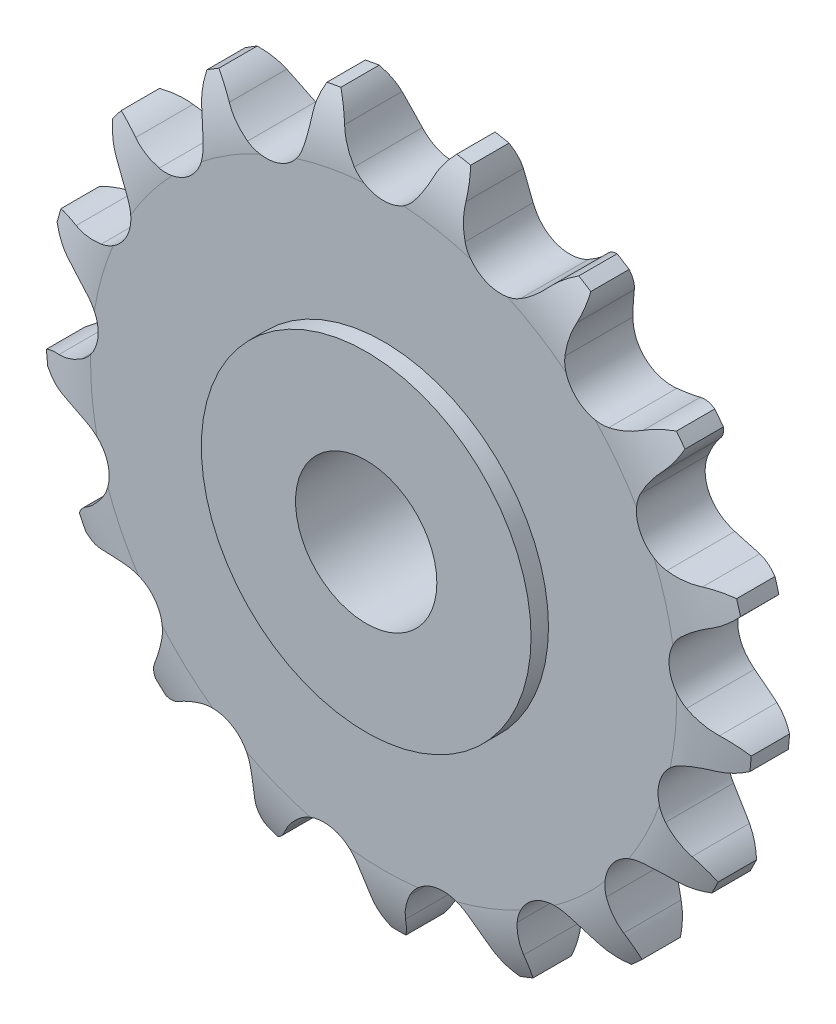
from build123d import *

# Parameters (mm, degrees)
CUT_EXTRUDE_1_DEPTH      = 54.31744555
CUT_EXTRUDE_1_DEPTH_BACK = 54.31744555


with BuildPart() as part:
    # Sketch 1 → Revolve 1 (revolve)
    with BuildSketch(Plane(origin=(0, 0, 0), x_dir=(0, 0, -1), z_dir=(1, 0, 0)), mode=Mode.PRIVATE) as revolve_1_sk:
        with BuildLine():
            Line((-5.5, 7.5), (-5.5, 17.5))
            Line((-5.5, 17.5), (-3.65, 17.5))
            Line((-3.65, 17.5), (-3.65, 31.1))
            ThreePointArc((-3.65, 31.1), (-3.240423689, 34.400122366), (-2.036547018, 37.5))
            Line((-2.036547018, 37.5), (2.036547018, 37.5))
            ThreePointArc((2.036547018, 37.5), (3.240424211, 34.400120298), (3.65, 31.099995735))
            Line((3.65, 31.099995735), (3.65, 17.5))
            Line((3.65, 17.5), (5.5, 17.5))
            Line((5.5, 17.5), (5.5, 7.5))
            Line((5.5, 7.5), (-5.5, 7.5))
        make_face()
    revolve(revolve_1_sk.sketch.rotate(Axis((0, 0, 10.5), (0, 0, -1)), 90), axis=Axis((0, 0, 10.5), (0, 0, -1)))

    # Sketch 2 → Cut-Extrude 1 (cut, two sides: drawn at the far end of the back side and taken through both)
    with BuildSketch(Plane.XY.offset(-CUT_EXTRUDE_1_DEPTH_BACK)):
        with BuildLine():
            ThreePointArc((6.147542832, 36.992671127), (-2e-09, 37.5), (-6.147542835, 36.992671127))
            ThreePointArc((-6.147542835, 36.992671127), (-5.332344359, 35.947140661), (-4.742176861, 34.759965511))
            ThreePointArc((-4.742176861, 34.759965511), (-4.055871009, 33.297555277), (-3.150969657, 31.959342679))
            ThreePointArc((-3.150969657, 31.959342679), (-1e-09, 30.4405), (3.150969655, 31.959342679))
            ThreePointArc((3.150969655, 31.959342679), (4.055871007, 33.297555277), (4.742176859, 34.759965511))
            ThreePointArc((4.742176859, 34.759965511), (5.332344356, 35.947140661), (6.147542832, 36.992671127))
        make_face()
        with BuildLine():
            ThreePointArc((19.095707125, 32.273889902), (13.54656248, 34.967708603), (7.630881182, 36.715387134))
            ThreePointArc((7.630881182, 36.715387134), (8.013341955, 35.445975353), (8.134799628, 34.125774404))
            ThreePointArc((8.134799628, 34.125774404), (8.246477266, 32.514195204), (8.606854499, 30.939461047))
            ThreePointArc((8.606854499, 30.939461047), (10.996376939, 28.3849209), (14.483237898, 28.66293799))
            ThreePointArc((14.483237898, 28.66293799), (15.810451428, 29.583896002), (16.978696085, 30.699630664))
            ThreePointArc((16.978696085, 30.699630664), (17.957868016, 31.593445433), (19.095707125, 32.273889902))
        make_face()
        with BuildLine():
            ThreePointArc((29.464890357, 23.19634101), (25.263586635, 27.712834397), (20.378712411, 31.479486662))
            ThreePointArc((20.378712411, 31.479486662), (20.276782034, 30.157634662), (19.913126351, 28.882708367))
            ThreePointArc((19.913126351, 28.882708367), (19.435093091, 27.339612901), (19.202275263, 25.741033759))
            ThreePointArc((19.202275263, 25.741033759), (20.50763224, 22.495800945), (23.859464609, 21.495444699))
            ThreePointArc((23.859464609, 21.495444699), (25.429742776, 21.874767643), (26.922148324, 22.493140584))
            ThreePointArc((26.922148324, 22.493140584), (28.158082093, 22.972880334), (29.464890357, 23.19634101))
        make_face()
        with BuildLine():
            ThreePointArc((35.854676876, 10.985997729), (33.568623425, 16.715188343), (30.374285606, 21.992107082))
            ThreePointArc((30.374285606, 21.992107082), (29.801730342, 20.7963383), (29.002075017, 19.73887252))
            ThreePointArc((29.002075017, 19.73887252), (27.998891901, 18.472664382), (27.204322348, 17.066137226))
            ThreePointArc((27.204322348, 17.066137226), (27.24921817, 13.56849842), (30.013338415, 11.424872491))
            ThreePointArc((30.013338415, 11.424872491), (31.61460645, 11.2113307), (33.22961525, 11.248827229))
            ThreePointArc((33.22961525, 11.248827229), (34.555391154, 11.249700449), (35.854676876, 10.985997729))
        make_face()
        with BuildLine():
            ThreePointArc((37.402090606, -2.708065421), (37.340031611, 3.460063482), (36.267643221, 9.534571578))
            ThreePointArc((36.267643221, 9.534571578), (35.30178983, 8.626381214), (34.174132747, 7.929192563))
            ThreePointArc((34.174132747, 7.929192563), (32.781285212, 7.110880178), (31.532274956, 6.086364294))
            ThreePointArc((31.532274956, 6.086364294), (30.310646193, 2.808694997), (32.113744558, -0.188692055))
            ThreePointArc((32.113744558, -0.188692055), (33.52974234, -0.966258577), (35.049238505, -1.514702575))
            ThreePointArc((35.049238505, -1.514702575), (36.285803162, -1.992813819), (37.402090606, -2.708065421))
        make_face()
        with BuildLine():
            ThreePointArc((33.898144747, -16.03638933), (36.068461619, -10.262362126), (37.262854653, -4.21066065))
            ThreePointArc((37.262854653, -4.21066065), (36.034146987, -4.708616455), (34.730784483, -4.951368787))
            ThreePointArc((34.730784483, -4.951368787), (33.136384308, -5.211267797), (31.601619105, -5.715405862))
            ThreePointArc((31.601619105, -5.715405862), (29.278453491, -8.330438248), (29.87701155, -11.776772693))
            ThreePointArc((29.87701155, -11.776772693), (30.916500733, -13.013349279), (32.135267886, -14.073663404))
            ThreePointArc((32.135267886, -14.073663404), (33.115616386, -14.966187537), (33.898144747, -16.03638933))
        make_face()
        with BuildLine():
            ThreePointArc((25.816066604, -27.198909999), (29.925646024, -22.598798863), (33.225511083, -17.387219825))
            ThreePointArc((33.225511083, -17.387219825), (31.899892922, -17.407689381), (30.596851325, -17.163220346))
            ThreePointArc((30.596851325, -17.163220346), (29.016231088, -16.82960518), (27.402989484, -16.745278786))
            ThreePointArc((27.402989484, -16.745278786), (24.292043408, -18.344499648), (23.605222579, -21.774334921))
            ThreePointArc((23.605222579, -21.774334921), (24.127814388, -23.302915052), (24.881251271, -24.731898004))
            ThreePointArc((24.881251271, -24.731898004), (25.472982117, -25.918294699), (25.816066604, -27.198909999))
        make_face()
        with BuildLine():
            ThreePointArc((14.247385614, -34.688067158), (19.741206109, -31.883142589), (24.700878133, -28.215538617))
            ThreePointArc((24.700878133, -28.215538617), (23.457381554, -27.755757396), (22.330643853, -27.057083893))
            ThreePointArc((22.330643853, -27.057083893), (20.977275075, -26.175011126), (19.503434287, -25.513609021))
            ThreePointArc((19.503434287, -25.513609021), (16.024858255, -25.88103472), (14.145417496, -28.831152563))
            ThreePointArc((14.145417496, -28.831152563), (14.080533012, -30.445293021), (14.2668838, -32.049952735))
            ThreePointArc((14.2668838, -32.049952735), (14.390080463, -33.369992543), (14.247385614, -34.688067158))
        make_face()
        with BuildLine():
            ThreePointArc((0.754516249, -37.492408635), (6.89060692, -36.861491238), (12.840254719, -35.233192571))
            ThreePointArc((12.840254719, -35.233192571), (11.846820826, -34.355256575), (11.04855919, -33.296738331))
            ThreePointArc((11.04855919, -33.296738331), (10.105221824, -31.98533678), (8.969832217, -30.836184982))
            ThreePointArc((8.969832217, -30.836184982), (5.593427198, -29.922192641), (2.775195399, -31.994163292))
            ThreePointArc((2.775195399, -31.994163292), (2.131597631, -33.475865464), (1.725694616, -35.039483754))
            ThreePointArc((1.725694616, -35.039483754), (1.363718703, -36.314887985), (0.754516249, -37.492408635))
        make_face()
        with BuildLine():
            ThreePointArc((-12.840254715, -35.233192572), (-6.890606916, -36.861491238), (-0.754516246, -37.492408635))
            ThreePointArc((-0.754516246, -37.492408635), (-1.363718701, -36.314887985), (-1.725694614, -35.039483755))
            ThreePointArc((-1.725694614, -35.039483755), (-2.131597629, -33.475865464), (-2.775195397, -31.994163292))
            ThreePointArc((-2.775195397, -31.994163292), (-5.593427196, -29.922192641), (-8.969832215, -30.836184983))
            ThreePointArc((-8.969832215, -30.836184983), (-10.105221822, -31.985336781), (-11.048559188, -33.296738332))
            ThreePointArc((-11.048559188, -33.296738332), (-11.846820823, -34.355256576), (-12.840254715, -35.233192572))
        make_face()
        with BuildLine():
            ThreePointArc((-24.70087813, -28.215538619), (-19.741206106, -31.883142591), (-14.247385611, -34.68806716))
            ThreePointArc((-14.247385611, -34.68806716), (-14.39008046, -33.369992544), (-14.266883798, -32.049952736))
            ThreePointArc((-14.266883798, -32.049952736), (-14.08053301, -30.445293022), (-14.145417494, -28.831152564))
            ThreePointArc((-14.145417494, -28.831152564), (-16.024858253, -25.881034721), (-19.503434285, -25.513609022))
            ThreePointArc((-19.503434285, -25.513609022), (-20.977275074, -26.175011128), (-22.330643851, -27.057083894))
            ThreePointArc((-22.330643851, -27.057083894), (-23.457381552, -27.755757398), (-24.70087813, -28.215538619))
        make_face()
        with BuildLine():
            ThreePointArc((-33.225511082, -17.387219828), (-29.925646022, -22.598798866), (-25.816066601, -27.198910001))
            ThreePointArc((-25.816066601, -27.198910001), (-25.472982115, -25.918294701), (-24.881251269, -24.731898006))
            ThreePointArc((-24.881251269, -24.731898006), (-24.127814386, -23.302915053), (-23.605222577, -21.774334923))
            ThreePointArc((-23.605222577, -21.774334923), (-24.292043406, -18.344499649), (-27.402989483, -16.745278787))
            ThreePointArc((-27.402989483, -16.745278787), (-29.016231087, -16.829605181), (-30.596851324, -17.163220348))
            ThreePointArc((-30.596851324, -17.163220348), (-31.899892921, -17.407689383), (-33.225511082, -17.387219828))
        make_face()
        with BuildLine():
            ThreePointArc((-37.262854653, -4.210660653), (-36.068461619, -10.262362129), (-33.898144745, -16.036389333))
            ThreePointArc((-33.898144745, -16.036389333), (-33.115616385, -14.96618754), (-32.135267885, -14.073663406))
            ThreePointArc((-32.135267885, -14.073663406), (-30.916500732, -13.013349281), (-29.87701155, -11.776772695))
            ThreePointArc((-29.87701155, -11.776772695), (-29.278453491, -8.33043825), (-31.601619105, -5.715405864))
            ThreePointArc((-31.601619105, -5.715405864), (-33.136384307, -5.211267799), (-34.730784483, -4.951368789))
            ThreePointArc((-34.730784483, -4.951368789), (-36.034146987, -4.708616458), (-37.262854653, -4.210660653))
        make_face()
        with BuildLine():
            ThreePointArc((-36.267643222, 9.534571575), (-37.340031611, 3.460063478), (-37.402090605, -2.708065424))
            ThreePointArc((-37.402090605, -2.708065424), (-36.285803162, -1.992813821), (-35.049238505, -1.514702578))
            ThreePointArc((-35.049238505, -1.514702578), (-33.52974234, -0.966258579), (-32.113744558, -0.188692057))
            ThreePointArc((-32.113744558, -0.188692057), (-30.310646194, 2.808694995), (-31.532274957, 6.086364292))
            ThreePointArc((-31.532274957, 6.086364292), (-32.781285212, 7.110880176), (-34.174132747, 7.929192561))
            ThreePointArc((-34.174132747, 7.929192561), (-35.30178983, 8.626381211), (-36.267643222, 9.534571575))
        make_face()
        with BuildLine():
            ThreePointArc((-30.374285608, 21.992107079), (-33.568623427, 16.71518834), (-35.854676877, 10.985997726))
            ThreePointArc((-35.854676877, 10.985997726), (-34.555391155, 11.249700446), (-33.229615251, 11.248827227))
            ThreePointArc((-33.229615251, 11.248827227), (-31.61460645, 11.211330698), (-30.013338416, 11.424872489))
            ThreePointArc((-30.013338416, 11.424872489), (-27.249218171, 13.568498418), (-27.204322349, 17.066137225))
            ThreePointArc((-27.204322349, 17.066137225), (-27.998891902, 18.472664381), (-29.002075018, 19.738872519))
            ThreePointArc((-29.002075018, 19.738872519), (-29.801730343, 20.796338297), (-30.374285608, 21.992107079))
        make_face()
        with BuildLine():
            ThreePointArc((-20.378712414, 31.47948666), (-25.263586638, 27.712834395), (-29.464890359, 23.196341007))
            ThreePointArc((-29.464890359, 23.196341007), (-28.158082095, 22.972880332), (-26.922148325, 22.493140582))
            ThreePointArc((-26.922148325, 22.493140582), (-25.429742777, 21.874767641), (-23.859464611, 21.495444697))
            ThreePointArc((-23.859464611, 21.495444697), (-20.507632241, 22.495800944), (-19.202275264, 25.741033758))
            ThreePointArc((-19.202275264, 25.741033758), (-19.435093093, 27.3396129), (-19.913126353, 28.882708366))
            ThreePointArc((-19.913126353, 28.882708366), (-20.276782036, 30.15763466), (-20.378712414, 31.47948666))
        make_face()
        with BuildLine():
            ThreePointArc((-14.483240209, 28.662939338), (-10.996379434, 28.384919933), (-8.606855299, 30.939458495))
            ThreePointArc((-8.606855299, 30.939458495), (-8.246477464, 32.514193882), (-8.13479963, 34.125774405))
            ThreePointArc((-8.13479963, 34.125774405), (-8.013341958, 35.445975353), (-7.630881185, 36.715387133))
            ThreePointArc((-7.630881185, 36.715387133), (-13.546562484, 34.967708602), (-19.095707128, 32.2738899))
            ThreePointArc((-19.095707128, 32.2738899), (-17.957868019, 31.593445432), (-16.978696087, 30.699630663))
            ThreePointArc((-16.978696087, 30.699630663), (-15.810452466, 29.583896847), (-14.483240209, 28.662939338))
        make_face()
    extrude(amount=CUT_EXTRUDE_1_DEPTH + CUT_EXTRUDE_1_DEPTH_BACK, mode=Mode.SUBTRACT)


solid = part.part
